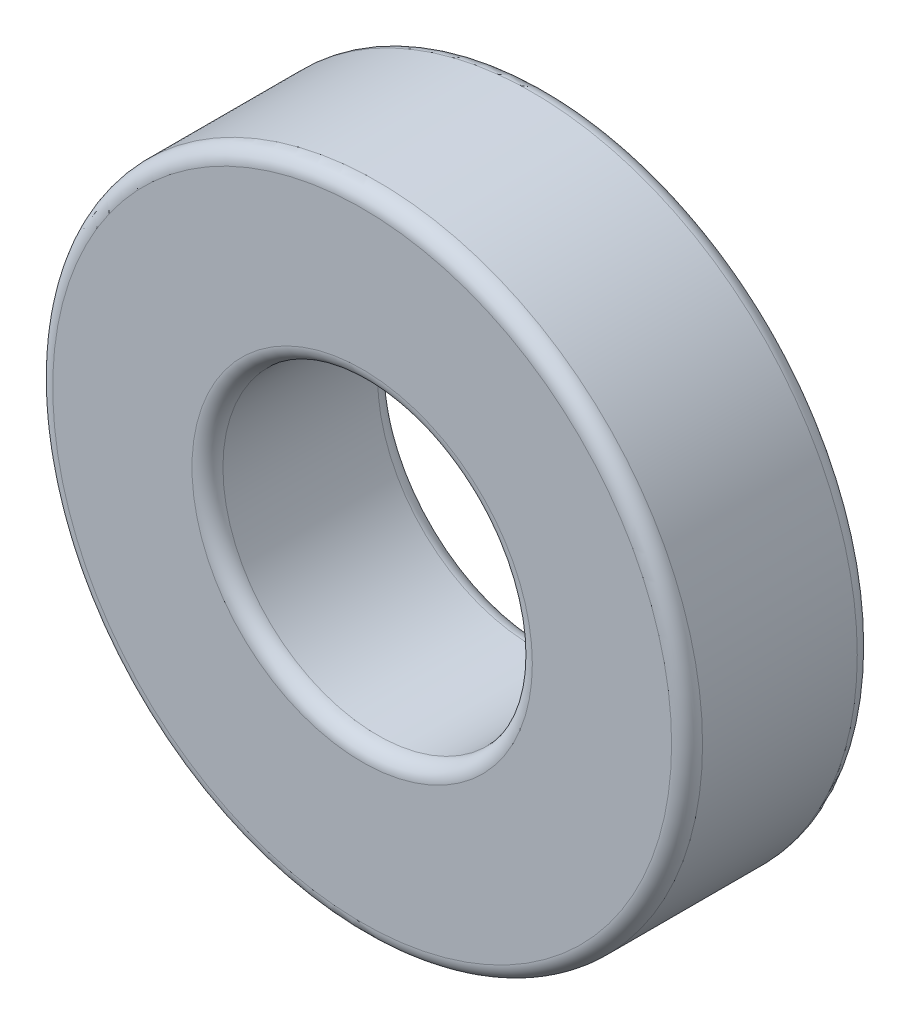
from build123d import *

# Parameters (mm, degrees)
ESQUISSE1_R      = 21
ESQUISSE1_R_2    = 10
EXTRUSION1_DEPTH = 12
CONG_1_R         = 1


with BuildPart() as part:
    # Esquisse1 → Extrusion1 (new body)
    with BuildSketch(Plane.XY):
        Circle(ESQUISSE1_R)
        Circle(ESQUISSE1_R_2, mode=Mode.SUBTRACT)
    extrude(amount=EXTRUSION1_DEPTH)

    # Cong_1
    cong_1_edges = [part.edges().sort_by_distance(p)[0] for p in [
        (-21, 0, 0),
        (-21, 0, 12),
        (-10, 0, 0),
        (-10, 0, 12),
    ]]
    fillet(cong_1_edges, radius=CONG_1_R)


solid = part.part
